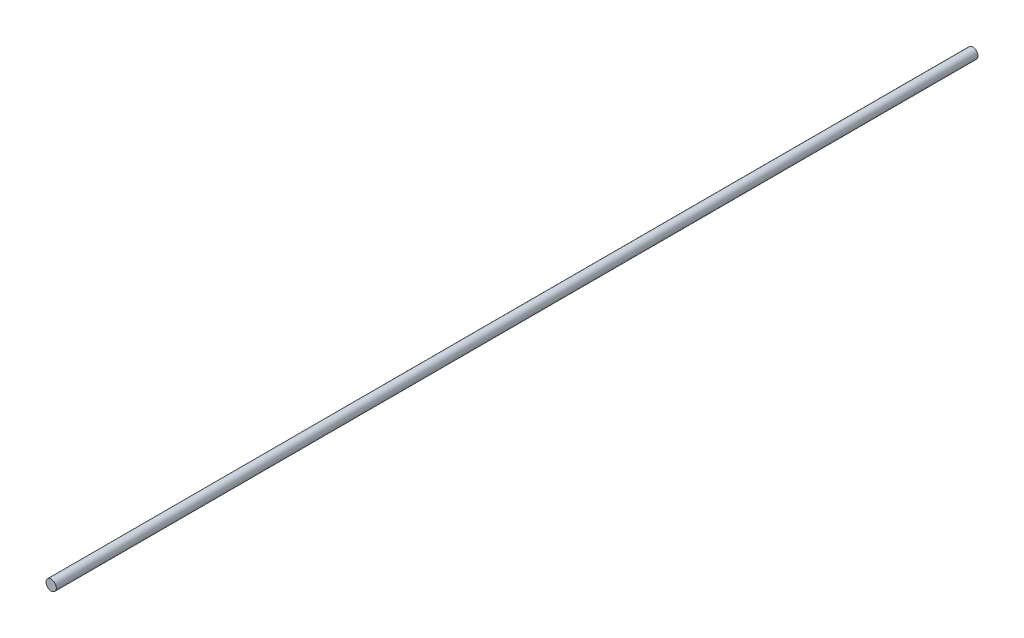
ISO-10303-21;
HEADER;
FILE_DESCRIPTION(('STEP AP214'),'2;1');
FILE_NAME('part.step','',(''),(''),'','','');
FILE_SCHEMA(('AUTOMOTIVE_DESIGN { 1 0 10303 214 1 1 1 1 }'));
ENDSEC;
DATA;
#1=APPLICATION_CONTEXT('core data for automotive mechanical design processes');
#2=APPLICATION_PROTOCOL_DEFINITION('international standard','automotive_design',2000,#1);
#3=PRODUCT_CONTEXT('',#1,'mechanical');
#4=PRODUCT('Part','Part','',(#3));
#5=PRODUCT_RELATED_PRODUCT_CATEGORY('part','',(#4));
#6=PRODUCT_DEFINITION_FORMATION('','',#4);
#7=PRODUCT_DEFINITION_CONTEXT('part definition',#1,'design');
#8=PRODUCT_DEFINITION('design','',#6,#7);
#9=PRODUCT_DEFINITION_SHAPE('','',#8);
#10=(LENGTH_UNIT() NAMED_UNIT(*) SI_UNIT(.MILLI.,.METRE.));
#11=(NAMED_UNIT(*) PLANE_ANGLE_UNIT() SI_UNIT($,.RADIAN.));
#12=(NAMED_UNIT(*) SI_UNIT($,.STERADIAN.) SOLID_ANGLE_UNIT());
#13=UNCERTAINTY_MEASURE_WITH_UNIT(LENGTH_MEASURE(1.E-05),#10,'distance_accuracy_value','');
#14=(GEOMETRIC_REPRESENTATION_CONTEXT(3) GLOBAL_UNCERTAINTY_ASSIGNED_CONTEXT((#13)) GLOBAL_UNIT_ASSIGNED_CONTEXT((#10,
#11,#12)) REPRESENTATION_CONTEXT('',''));
#15=CARTESIAN_POINT('',(0.,0.,0.));
#16=DIRECTION('',(0.,0.,1.));
#17=DIRECTION('',(1.,0.,0.));
#18=AXIS2_PLACEMENT_3D('',#15,#16,#17);
#19=CARTESIAN_POINT('',(0.,0.,-5350.));
#20=DIRECTION('',(0.,0.,1.));
#21=DIRECTION('',(1.,0.,0.));
#22=AXIS2_PLACEMENT_3D('',#19,#20,#21);
#23=CYLINDRICAL_SURFACE('',#22,30.);
#24=CARTESIAN_POINT('',(0.,0.,-5350.));
#25=DIRECTION('',(0.,0.,1.));
#26=DIRECTION('',(1.,0.,0.));
#27=AXIS2_PLACEMENT_3D('',#24,#25,#26);
#28=CIRCLE('',#27,30.);
#29=CARTESIAN_POINT('',(30.,0.,-5350.));
#30=VERTEX_POINT('',#29);
#31=EDGE_CURVE('E10',#30,#30,#28,.T.);
#32=ORIENTED_EDGE('',*,*,#31,.T.);
#33=EDGE_LOOP('',(#32));
#34=FACE_BOUND('',#33,.T.);
#35=CARTESIAN_POINT('',(0.,0.,0.));
#36=DIRECTION('',(0.,0.,1.));
#37=DIRECTION('',(1.,0.,0.));
#38=AXIS2_PLACEMENT_3D('',#35,#36,#37);
#39=CIRCLE('',#38,30.);
#40=CARTESIAN_POINT('',(30.,0.,0.));
#41=VERTEX_POINT('',#40);
#42=EDGE_CURVE('E40',#41,#41,#39,.T.);
#43=ORIENTED_EDGE('',*,*,#42,.F.);
#44=EDGE_LOOP('',(#43));
#45=FACE_BOUND('',#44,.T.);
#46=ADVANCED_FACE('F37',(#34,#45),#23,.T.);
#47=CARTESIAN_POINT('',(0.,0.,-5350.));
#48=DIRECTION('',(0.,0.,1.));
#49=DIRECTION('',(1.,0.,0.));
#50=AXIS2_PLACEMENT_3D('',#47,#48,#49);
#51=PLANE('',#50);
#52=ORIENTED_EDGE('',*,*,#31,.F.);
#53=EDGE_LOOP('',(#52));
#54=FACE_BOUND('',#53,.T.);
#55=ADVANCED_FACE('F54',(#54),#51,.F.);
#56=CARTESIAN_POINT('',(0.,0.,0.));
#57=DIRECTION('',(0.,0.,1.));
#58=DIRECTION('',(1.,0.,0.));
#59=AXIS2_PLACEMENT_3D('',#56,#57,#58);
#60=PLANE('',#59);
#61=ORIENTED_EDGE('',*,*,#42,.T.);
#62=EDGE_LOOP('',(#61));
#63=FACE_BOUND('',#62,.T.);
#64=ADVANCED_FACE('F51',(#63),#60,.T.);
#65=CLOSED_SHELL('',(#46,#55,#64));
#66=MANIFOLD_SOLID_BREP('B2',#65);
#67=ADVANCED_BREP_SHAPE_REPRESENTATION('',(#18,#66),#14);
#68=SHAPE_DEFINITION_REPRESENTATION(#9,#67);
ENDSEC;
END-ISO-10303-21;
